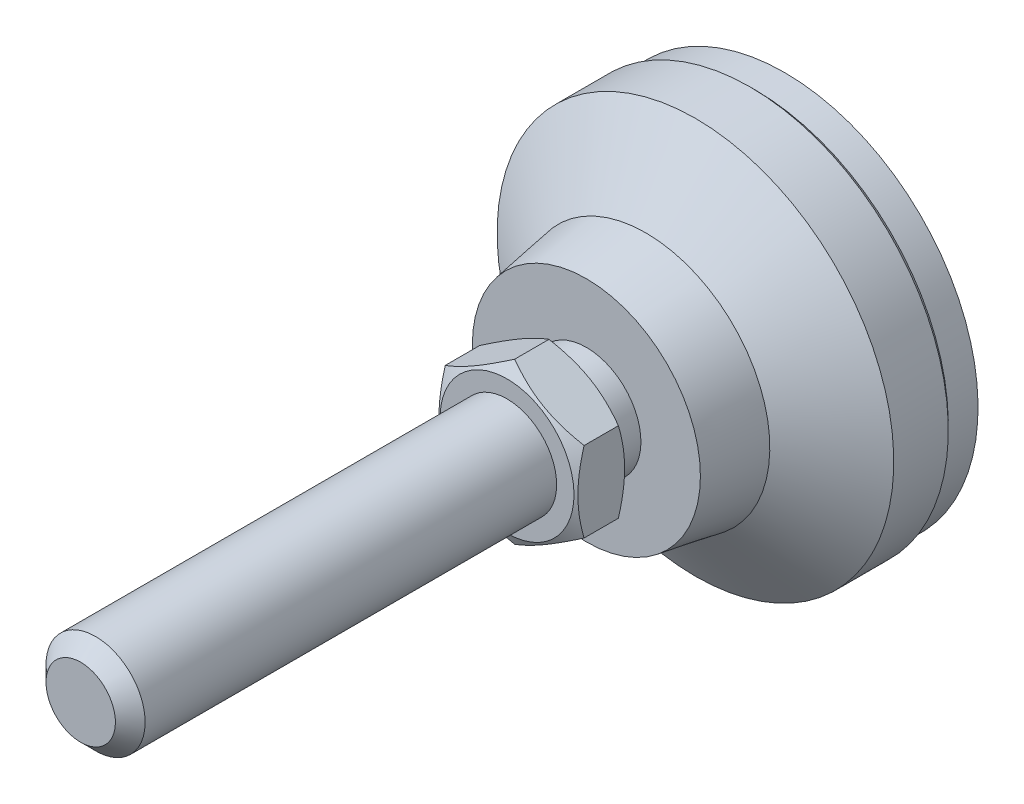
ISO-10303-21;
HEADER;
FILE_DESCRIPTION(('STEP AP214'),'2;1');
FILE_NAME('part.step','',(''),(''),'','','');
FILE_SCHEMA(('AUTOMOTIVE_DESIGN { 1 0 10303 214 1 1 1 1 }'));
ENDSEC;
DATA;
#1=APPLICATION_CONTEXT('core data for automotive mechanical design processes');
#2=APPLICATION_PROTOCOL_DEFINITION('international standard','automotive_design',2000,#1);
#3=PRODUCT_CONTEXT('',#1,'mechanical');
#4=PRODUCT('Part','Part','',(#3));
#5=PRODUCT_RELATED_PRODUCT_CATEGORY('part','',(#4));
#6=PRODUCT_DEFINITION_FORMATION('','',#4);
#7=PRODUCT_DEFINITION_CONTEXT('part definition',#1,'design');
#8=PRODUCT_DEFINITION('design','',#6,#7);
#9=PRODUCT_DEFINITION_SHAPE('','',#8);
#10=(LENGTH_UNIT() NAMED_UNIT(*) SI_UNIT(.MILLI.,.METRE.));
#11=(NAMED_UNIT(*) PLANE_ANGLE_UNIT() SI_UNIT($,.RADIAN.));
#12=(NAMED_UNIT(*) SI_UNIT($,.STERADIAN.) SOLID_ANGLE_UNIT());
#13=UNCERTAINTY_MEASURE_WITH_UNIT(LENGTH_MEASURE(1.E-05),#10,'distance_accuracy_value','');
#14=(GEOMETRIC_REPRESENTATION_CONTEXT(3) GLOBAL_UNCERTAINTY_ASSIGNED_CONTEXT((#13)) GLOBAL_UNIT_ASSIGNED_CONTEXT((#10,
#11,#12)) REPRESENTATION_CONTEXT('',''));
#15=CARTESIAN_POINT('',(0.,0.,0.));
#16=DIRECTION('',(0.,0.,1.));
#17=DIRECTION('',(1.,0.,0.));
#18=AXIS2_PLACEMENT_3D('',#15,#16,#17);
#19=CARTESIAN_POINT('',(0.,0.,1.99999999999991));
#20=DIRECTION('',(0.,0.,-1.));
#21=DIRECTION('',(0.,1.,0.));
#22=AXIS2_PLACEMENT_3D('',#19,#20,#21);
#23=CYLINDRICAL_SURFACE('',#22,20.);
#24=CARTESIAN_POINT('',(0.,0.,3.5));
#25=DIRECTION('',(0.,0.,-1.));
#26=DIRECTION('',(0.,1.,0.));
#27=AXIS2_PLACEMENT_3D('',#24,#25,#26);
#28=CIRCLE('',#27,20.);
#29=CARTESIAN_POINT('',(0.,20.,3.5));
#30=VERTEX_POINT('',#29);
#31=EDGE_CURVE('E114',#30,#30,#28,.F.);
#32=ORIENTED_EDGE('',*,*,#31,.T.);
#33=EDGE_LOOP('',(#32));
#34=FACE_BOUND('',#33,.T.);
#35=CARTESIAN_POINT('',(0.,0.,9.));
#36=DIRECTION('',(0.,0.,-1.));
#37=DIRECTION('',(0.,1.,0.));
#38=AXIS2_PLACEMENT_3D('',#35,#36,#37);
#39=CIRCLE('',#38,20.);
#40=CARTESIAN_POINT('',(0.,20.,9.));
#41=VERTEX_POINT('',#40);
#42=EDGE_CURVE('E108',#41,#41,#39,.T.);
#43=ORIENTED_EDGE('',*,*,#42,.T.);
#44=EDGE_LOOP('',(#43));
#45=FACE_BOUND('',#44,.T.);
#46=ADVANCED_FACE('F14',(#34,#45),#23,.T.);
#47=CARTESIAN_POINT('',(0.,0.,14.));
#48=DIRECTION('',(0.,0.,-1.));
#49=DIRECTION('',(0.,1.,0.));
#50=AXIS2_PLACEMENT_3D('',#47,#48,#49);
#51=CONICAL_SURFACE('',#50,12.5,0.98279372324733);
#52=ORIENTED_EDGE('',*,*,#42,.F.);
#53=EDGE_LOOP('',(#52));
#54=FACE_BOUND('',#53,.T.);
#55=CARTESIAN_POINT('',(0.,0.,14.));
#56=DIRECTION('',(0.,0.,-1.));
#57=DIRECTION('',(0.,1.,0.));
#58=AXIS2_PLACEMENT_3D('',#55,#56,#57);
#59=CIRCLE('',#58,12.5);
#60=CARTESIAN_POINT('',(0.,12.5,14.));
#61=VERTEX_POINT('',#60);
#62=EDGE_CURVE('E105',#61,#61,#59,.T.);
#63=ORIENTED_EDGE('',*,*,#62,.T.);
#64=EDGE_LOOP('',(#63));
#65=FACE_BOUND('',#64,.T.);
#66=ADVANCED_FACE('F230',(#54,#65),#51,.T.);
#67=CARTESIAN_POINT('',(0.,0.,20.));
#68=DIRECTION('',(0.,0.,-1.));
#69=DIRECTION('',(0.,1.,0.));
#70=AXIS2_PLACEMENT_3D('',#67,#68,#69);
#71=CONICAL_SURFACE('',#70,11.5,0.165148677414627);
#72=ORIENTED_EDGE('',*,*,#62,.F.);
#73=EDGE_LOOP('',(#72));
#74=FACE_BOUND('',#73,.T.);
#75=CARTESIAN_POINT('',(0.,0.,20.));
#76=DIRECTION('',(0.,0.,-1.));
#77=DIRECTION('',(0.,1.,0.));
#78=AXIS2_PLACEMENT_3D('',#75,#76,#77);
#79=CIRCLE('',#78,11.5);
#80=CARTESIAN_POINT('',(0.,11.5,20.));
#81=VERTEX_POINT('',#80);
#82=EDGE_CURVE('E102',#81,#81,#79,.T.);
#83=ORIENTED_EDGE('',*,*,#82,.T.);
#84=EDGE_LOOP('',(#83));
#85=FACE_BOUND('',#84,.T.);
#86=ADVANCED_FACE('F226',(#74,#85),#71,.T.);
#87=CARTESIAN_POINT('',(-11.5,0.,20.));
#88=DIRECTION('',(0.,0.,-1.));
#89=DIRECTION('',(0.,1.,0.));
#90=AXIS2_PLACEMENT_3D('',#87,#88,#89);
#91=PLANE('',#90);
#92=ORIENTED_EDGE('',*,*,#82,.F.);
#93=EDGE_LOOP('',(#92));
#94=FACE_BOUND('',#93,.T.);
#95=CARTESIAN_POINT('',(0.,0.,20.));
#96=DIRECTION('',(0.,0.,-1.));
#97=DIRECTION('',(0.,1.,0.));
#98=AXIS2_PLACEMENT_3D('',#95,#96,#97);
#99=CIRCLE('',#98,5.49999999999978);
#100=CARTESIAN_POINT('',(0.,5.49999999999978,20.));
#101=VERTEX_POINT('',#100);
#102=EDGE_CURVE('E99',#101,#101,#99,.T.);
#103=ORIENTED_EDGE('',*,*,#102,.T.);
#104=EDGE_LOOP('',(#103));
#105=FACE_BOUND('',#104,.T.);
#106=ADVANCED_FACE('F222',(#94,#105),#91,.F.);
#107=CARTESIAN_POINT('',(0.,0.,1.99999999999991));
#108=DIRECTION('',(0.,0.,-1.));
#109=DIRECTION('',(0.,1.,0.));
#110=AXIS2_PLACEMENT_3D('',#107,#108,#109);
#111=CYLINDRICAL_SURFACE('',#110,5.49999999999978);
#112=ORIENTED_EDGE('',*,*,#102,.F.);
#113=EDGE_LOOP('',(#112));
#114=FACE_BOUND('',#113,.T.);
#115=CARTESIAN_POINT('',(0.,0.,23.));
#116=DIRECTION('',(0.,0.,-1.));
#117=DIRECTION('',(0.,1.,0.));
#118=AXIS2_PLACEMENT_3D('',#115,#116,#117);
#119=CIRCLE('',#118,5.49999999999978);
#120=CARTESIAN_POINT('',(0.,5.49999999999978,23.));
#121=VERTEX_POINT('',#120);
#122=EDGE_CURVE('E96',#121,#121,#119,.T.);
#123=ORIENTED_EDGE('',*,*,#122,.T.);
#124=EDGE_LOOP('',(#123));
#125=FACE_BOUND('',#124,.T.);
#126=ADVANCED_FACE('F218',(#114,#125),#111,.T.);
#127=CARTESIAN_POINT('',(-5.49999999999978,0.,23.));
#128=DIRECTION('',(0.,0.,1.));
#129=DIRECTION('',(0.,-1.,0.));
#130=AXIS2_PLACEMENT_3D('',#127,#128,#129);
#131=PLANE('',#130);
#132=CARTESIAN_POINT('',(0.,0.,23.));
#133=DIRECTION('',(0.,0.,1.));
#134=DIRECTION('',(0.,-1.,0.));
#135=AXIS2_PLACEMENT_3D('',#132,#133,#134);
#136=CIRCLE('',#135,6.75);
#137=CARTESIAN_POINT('',(0.,-6.75,23.));
#138=VERTEX_POINT('',#137);
#139=EDGE_CURVE('E304',#138,#138,#136,.T.);
#140=ORIENTED_EDGE('',*,*,#139,.F.);
#141=EDGE_LOOP('',(#140));
#142=FACE_BOUND('',#141,.T.);
#143=ORIENTED_EDGE('',*,*,#122,.F.);
#144=EDGE_LOOP('',(#143));
#145=FACE_BOUND('',#144,.T.);
#146=ADVANCED_FACE('F215',(#142,#145),#131,.F.);
#147=CARTESIAN_POINT('',(0.,0.,3.));
#148=DIRECTION('',(0.,0.,1.));
#149=DIRECTION('',(0.,-1.,0.));
#150=AXIS2_PLACEMENT_3D('',#147,#148,#149);
#151=CONICAL_SURFACE('',#150,19.5,0.785398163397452);
#152=ORIENTED_EDGE('',*,*,#31,.F.);
#153=EDGE_LOOP('',(#152));
#154=FACE_BOUND('',#153,.T.);
#155=CARTESIAN_POINT('',(0.,0.,3.));
#156=DIRECTION('',(0.,0.,-1.));
#157=DIRECTION('',(0.,1.,0.));
#158=AXIS2_PLACEMENT_3D('',#155,#156,#157);
#159=CIRCLE('',#158,19.5);
#160=CARTESIAN_POINT('',(0.,19.5,3.));
#161=VERTEX_POINT('',#160);
#162=EDGE_CURVE('E111',#161,#161,#159,.T.);
#163=ORIENTED_EDGE('',*,*,#162,.F.);
#164=EDGE_LOOP('',(#163));
#165=FACE_BOUND('',#164,.T.);
#166=ADVANCED_FACE('F16',(#154,#165),#151,.T.);
#167=CARTESIAN_POINT('',(0.,0.,0.));
#168=DIRECTION('',(0.,0.,1.));
#169=DIRECTION('',(0.,-1.,0.));
#170=AXIS2_PLACEMENT_3D('',#167,#168,#169);
#171=CYLINDRICAL_SURFACE('',#170,19.5);
#172=CARTESIAN_POINT('',(0.,0.,0.));
#173=DIRECTION('',(0.,0.,-1.));
#174=DIRECTION('',(0.,1.,0.));
#175=AXIS2_PLACEMENT_3D('',#172,#173,#174);
#176=CIRCLE('',#175,19.5);
#177=CARTESIAN_POINT('',(0.,19.5,0.));
#178=VERTEX_POINT('',#177);
#179=EDGE_CURVE('E277',#178,#178,#176,.T.);
#180=ORIENTED_EDGE('',*,*,#179,.F.);
#181=EDGE_LOOP('',(#180));
#182=FACE_BOUND('',#181,.T.);
#183=ORIENTED_EDGE('',*,*,#162,.T.);
#184=EDGE_LOOP('',(#183));
#185=FACE_BOUND('',#184,.T.);
#186=ADVANCED_FACE('F255',(#182,#185),#171,.T.);
#187=CARTESIAN_POINT('',(0.,0.,0.));
#188=DIRECTION('',(0.,0.,-1.));
#189=DIRECTION('',(0.,1.,0.));
#190=AXIS2_PLACEMENT_3D('',#187,#188,#189);
#191=PLANE('',#190);
#192=ORIENTED_EDGE('',*,*,#179,.T.);
#193=EDGE_LOOP('',(#192));
#194=FACE_BOUND('',#193,.T.);
#195=ADVANCED_FACE('F134',(#194),#191,.T.);
#196=CARTESIAN_POINT('',(0.,0.,23.));
#197=DIRECTION('',(0.,0.,1.));
#198=DIRECTION('',(0.,-1.,0.));
#199=AXIS2_PLACEMENT_3D('',#196,#197,#198);
#200=CONICAL_SURFACE('',#199,6.75,1.0471975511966);
#201=CARTESIAN_POINT('',(0.000200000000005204,-8.08301923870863,23.7696190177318));
#202=CARTESIAN_POINT('',(-0.153667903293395,-7.99418356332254,23.7183374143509));
#203=CARTESIAN_POINT('',(-0.308109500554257,-7.90501666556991,23.669383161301));
#204=CARTESIAN_POINT('',(-0.618246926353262,-7.72595873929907,23.5767703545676));
#205=CARTESIAN_POINT('',(-0.773943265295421,-7.63606741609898,23.5331140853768));
#206=CARTESIAN_POINT('',(-1.24352516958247,-7.36495417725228,23.4109491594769));
#207=CARTESIAN_POINT('',(-1.55926433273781,-7.18266208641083,23.3414631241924));
#208=CARTESIAN_POINT('',(-2.03176224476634,-6.90986528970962,23.2599825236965));
#209=CARTESIAN_POINT('',(-2.1871092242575,-6.82017566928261,23.2367710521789));
#210=CARTESIAN_POINT('',(-2.49850511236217,-6.64039116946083,23.1978487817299));
#211=CARTESIAN_POINT('',(-2.65455395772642,-6.55029632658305,23.1821373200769));
#212=CARTESIAN_POINT('',(-2.96692267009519,-6.36995016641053,23.1586154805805));
#213=CARTESIAN_POINT('',(-3.12324202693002,-6.27969914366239,23.1507961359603));
#214=CARTESIAN_POINT('',(-3.43601650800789,-6.09911871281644,23.1432178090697));
#215=CARTESIAN_POINT('',(-3.59247162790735,-6.00878930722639,23.1434585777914));
#216=CARTESIAN_POINT('',(-4.02110687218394,-5.76131663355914,23.1551972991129));
#217=CARTESIAN_POINT('',(-4.2931466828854,-5.60425437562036,23.1749033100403));
#218=CARTESIAN_POINT('',(-4.83541944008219,-5.29117305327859,23.2373910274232));
#219=CARTESIAN_POINT('',(-5.10565047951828,-5.13515508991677,23.2801940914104));
#220=CARTESIAN_POINT('',(-5.64901454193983,-4.82144370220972,23.3871892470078));
#221=CARTESIAN_POINT('',(-5.92207900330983,-4.66378986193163,23.4518346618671));
#222=CARTESIAN_POINT('',(-6.46413578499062,-4.35083323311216,23.5985536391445));
#223=CARTESIAN_POINT('',(-6.73313504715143,-4.19552643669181,23.680592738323));
#224=CARTESIAN_POINT('',(-7.0002,-4.04133641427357,23.7696190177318));
#225=B_SPLINE_CURVE_WITH_KNOTS('',3,(#201,#202,#203,#204,#205,#206,#207,#208,#209,#210,#211,
#212,#213,#214,#215,#216,#217,#218,#219,#220,#221,#222,#223,#224),.UNSPECIFIED.,.F.,.F.,(4,2,2,
2,2,2,2,2,2,2,2,4),(0.,0.554727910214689,1.10969417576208,2.2219327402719,2.76443041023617,
3.30688013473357,3.8487128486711,4.39052882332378,5.33376515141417,6.27787517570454,
7.24292418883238,8.20607866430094),.UNSPECIFIED.);
#226=CARTESIAN_POINT('',(0.,-8.08290376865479,23.7695523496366));
#227=VERTEX_POINT('',#226);
#228=CARTESIAN_POINT('',(-7.,-4.04145188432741,23.7695523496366));
#229=VERTEX_POINT('',#228);
#230=EDGE_CURVE('E73',#227,#229,#225,.T.);
#231=ORIENTED_EDGE('',*,*,#230,.T.);
#232=CARTESIAN_POINT('',(-7.,10.8625008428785,26.5637597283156));
#233=CARTESIAN_POINT('',(-7.,10.5567081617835,26.4153960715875));
#234=CARTESIAN_POINT('',(-7.,10.2502142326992,26.2684530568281));
#235=CARTESIAN_POINT('',(-7.,9.63545096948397,25.978207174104));
#236=CARTESIAN_POINT('',(-7.,9.32718136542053,25.8349048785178));
#237=CARTESIAN_POINT('',(-7.,8.70690876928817,25.5520197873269));
#238=CARTESIAN_POINT('',(-7.,8.39489459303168,25.4124614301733));
#239=CARTESIAN_POINT('',(-7.,7.76838697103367,25.1390469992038));
#240=CARTESIAN_POINT('',(-7.,7.45389364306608,25.005190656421));
#241=CARTESIAN_POINT('',(-7.,6.81175153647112,24.7404908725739));
#242=CARTESIAN_POINT('',(-7.,6.48400510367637,24.6098830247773));
#243=CARTESIAN_POINT('',(-7.,5.82468108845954,24.3585360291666));
#244=CARTESIAN_POINT('',(-7.,5.4931030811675,24.2377979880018));
#245=CARTESIAN_POINT('',(-7.,4.82620282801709,24.0093556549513));
#246=CARTESIAN_POINT('',(-7.,4.49088969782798,23.9016250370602));
#247=CARTESIAN_POINT('',(-7.,3.81546553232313,23.7026486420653));
#248=CARTESIAN_POINT('',(-7.,3.47535604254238,23.6113976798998));
#249=CARTESIAN_POINT('',(-7.,2.79197817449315,23.45024692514));
#250=CARTESIAN_POINT('',(-7.,2.44873790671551,23.3802311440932));
#251=CARTESIAN_POINT('',(-7.,1.93074648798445,23.2941616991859));
#252=CARTESIAN_POINT('',(-7.,1.75754818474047,23.2686297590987));
#253=CARTESIAN_POINT('',(-7.,1.41028841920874,23.2243845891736));
#254=CARTESIAN_POINT('',(-7.,1.23622704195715,23.205670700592));
#255=CARTESIAN_POINT('',(-7.,0.889751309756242,23.1756695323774));
#256=CARTESIAN_POINT('',(-7.,0.717345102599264,23.1642885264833));
#257=CARTESIAN_POINT('',(-7.,0.372205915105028,23.1488276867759));
#258=CARTESIAN_POINT('',(-7.,0.19947294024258,23.1447477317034));
#259=CARTESIAN_POINT('',(-7.,-0.146010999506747,23.1439863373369));
#260=CARTESIAN_POINT('',(-7.,-0.318761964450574,23.1473049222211));
#261=CARTESIAN_POINT('',(-7.,-0.663970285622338,23.1612594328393));
#262=CARTESIAN_POINT('',(-7.,-0.836427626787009,23.1718957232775));
#263=CARTESIAN_POINT('',(-7.,-1.25068890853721,23.2060092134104));
#264=CARTESIAN_POINT('',(-7.,-1.49221390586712,23.2329469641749));
#265=CARTESIAN_POINT('',(-7.,-1.97346436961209,23.2997070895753));
#266=CARTESIAN_POINT('',(-7.,-2.21318958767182,23.3395312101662));
#267=CARTESIAN_POINT('',(-7.,-2.9293952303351,23.4762208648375));
#268=CARTESIAN_POINT('',(-7.,-3.4026374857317,23.5902786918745));
#269=CARTESIAN_POINT('',(-7.,-4.11027375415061,23.7879838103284));
#270=CARTESIAN_POINT('',(-7.,-4.34834017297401,23.8592419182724));
#271=CARTESIAN_POINT('',(-7.,-4.82216059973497,24.009139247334));
#272=CARTESIAN_POINT('',(-7.,-5.05791459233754,24.0877785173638));
#273=CARTESIAN_POINT('',(-7.,-5.52718474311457,24.2511780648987));
#274=CARTESIAN_POINT('',(-7.,-5.76070161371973,24.3359363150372));
#275=CARTESIAN_POINT('',(-7.,-6.22580187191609,24.5105785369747));
#276=CARTESIAN_POINT('',(-7.,-6.45738528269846,24.6004624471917));
#277=CARTESIAN_POINT('',(-7.,-7.00610792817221,24.8193124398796));
#278=CARTESIAN_POINT('',(-7.,-7.32247845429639,24.9502024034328));
#279=CARTESIAN_POINT('',(-7.,-7.95251186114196,25.2183630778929));
#280=CARTESIAN_POINT('',(-7.,-8.26617457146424,25.3556341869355));
#281=CARTESIAN_POINT('',(-7.,-8.89129388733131,25.6352681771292));
#282=CARTESIAN_POINT('',(-7.,-9.20275002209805,25.7776321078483));
#283=CARTESIAN_POINT('',(-7.,-9.82377465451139,26.0664265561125));
#284=CARTESIAN_POINT('',(-7.,-10.1333431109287,26.2128571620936));
#285=CARTESIAN_POINT('',(-7.,-10.7512327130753,26.5091752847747));
#286=CARTESIAN_POINT('',(-7.,-11.0595521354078,26.6590663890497));
#287=CARTESIAN_POINT('',(-7.,-11.674858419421,26.9615616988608));
#288=CARTESIAN_POINT('',(-7.,-11.9818452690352,27.1141659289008));
#289=CARTESIAN_POINT('',(-7.,-12.9010435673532,27.5752812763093));
#290=CARTESIAN_POINT('',(-7.,-13.5115774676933,27.8871360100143));
#291=CARTESIAN_POINT('',(-7.,-14.6778741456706,28.4904503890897));
#292=CARTESIAN_POINT('',(-7.,-15.2339003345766,28.7814031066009));
#293=CARTESIAN_POINT('',(-7.,-16.343890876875,29.3672608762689));
#294=CARTESIAN_POINT('',(-7.,-16.8978551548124,29.6621660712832));
#295=CARTESIAN_POINT('',(-7.,-18.0027779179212,30.2542339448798));
#296=CARTESIAN_POINT('',(-7.,-18.5537404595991,30.5513890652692));
#297=CARTESIAN_POINT('',(-7.,-19.6543487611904,31.1480557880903));
#298=CARTESIAN_POINT('',(-7.,-20.2039945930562,31.44756725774));
#299=CARTESIAN_POINT('',(-7.,-20.7531565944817,31.7479573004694));
#300=B_SPLINE_CURVE_WITH_KNOTS('',3,(#232,#233,#234,#235,#236,#237,#238,#239,#240,#241,#242,
#243,#244,#245,#246,#247,#248,#249,#250,#251,#252,#253,#254,#255,#256,#257,#258,#259,#260,#261,
#262,#263,#264,#265,#266,#267,#268,#269,#270,#271,#272,#273,#274,#275,#276,#277,#278,#279,#280,
#281,#282,#283,#284,#285,#286,#287,#288,#289,#290,#291,#292,#293,#294,#295,#296,#297,#298,#299),
.UNSPECIFIED.,.F.,.F.,(4,2,2,2,2,2,2,2,2,2,2,2,2,2,2,2,2,2,2,2,2,2,2,2,2,2,2,2,2,2,2,2,2,4),(0.,
1.01966355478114,2.03948643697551,3.06485011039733,4.09016536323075,5.14847727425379,
6.20690768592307,7.26315867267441,8.31907674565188,9.36911888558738,9.89421604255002,
10.4192624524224,10.9374573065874,11.4556435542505,11.9738314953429,12.4920452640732,
13.2207013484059,13.9494561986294,15.4077702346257,16.1532147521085,16.8986642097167,
17.6438678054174,18.3890624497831,19.4161007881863,20.4432032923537,21.4705187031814,
22.497856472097,23.526311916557,24.5547766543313,26.6114239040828,28.4940560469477,
30.3767564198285,32.2547141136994,34.1325667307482),.UNSPECIFIED.);
#301=CARTESIAN_POINT('',(-7.,4.04145188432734,23.7695523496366));
#302=VERTEX_POINT('',#301);
#303=EDGE_CURVE('E81',#229,#302,#300,.F.);
#304=ORIENTED_EDGE('',*,*,#303,.T.);
#305=CARTESIAN_POINT('',(-7.0002,4.0413364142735,23.7696190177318));
#306=CARTESIAN_POINT('',(-6.8463320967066,4.13017208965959,23.7183374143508));
#307=CARTESIAN_POINT('',(-6.69189049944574,4.21933898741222,23.669383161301));
#308=CARTESIAN_POINT('',(-6.38175307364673,4.39839691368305,23.5767703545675));
#309=CARTESIAN_POINT('',(-6.22605673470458,4.48828823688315,23.5331140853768));
#310=CARTESIAN_POINT('',(-5.75647483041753,4.75940147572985,23.4109491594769));
#311=CARTESIAN_POINT('',(-5.4407356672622,4.94169356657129,23.3414631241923));
#312=CARTESIAN_POINT('',(-4.96823775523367,5.2144903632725,23.2599825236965));
#313=CARTESIAN_POINT('',(-4.81289077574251,5.30417998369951,23.2367710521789));
#314=CARTESIAN_POINT('',(-4.50149488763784,5.48396448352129,23.1978487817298));
#315=CARTESIAN_POINT('',(-4.34544604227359,5.57405932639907,23.1821373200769));
#316=CARTESIAN_POINT('',(-4.03307732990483,5.75440548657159,23.1586154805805));
#317=CARTESIAN_POINT('',(-3.87675797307,5.84465650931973,23.1507961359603));
#318=CARTESIAN_POINT('',(-3.56398349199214,6.02523694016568,23.1432178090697));
#319=CARTESIAN_POINT('',(-3.40752837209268,6.11556634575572,23.1434585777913));
#320=CARTESIAN_POINT('',(-2.97889312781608,6.36303901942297,23.1551972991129));
#321=CARTESIAN_POINT('',(-2.70685331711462,6.52010127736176,23.1749033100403));
#322=CARTESIAN_POINT('',(-2.16458055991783,6.83318259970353,23.2373910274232));
#323=CARTESIAN_POINT('',(-1.89434952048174,6.98920056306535,23.2801940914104));
#324=CARTESIAN_POINT('',(-1.35098545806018,7.3029119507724,23.3871892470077));
#325=CARTESIAN_POINT('',(-1.07792099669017,7.4605657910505,23.4518346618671));
#326=CARTESIAN_POINT('',(-0.535864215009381,7.77352241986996,23.5985536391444));
#327=CARTESIAN_POINT('',(-0.266864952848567,7.92882921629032,23.6805927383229));
#328=CARTESIAN_POINT('',(0.000200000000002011,8.08301923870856,23.7696190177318));
#329=B_SPLINE_CURVE_WITH_KNOTS('',3,(#305,#306,#307,#308,#309,#310,#311,#312,#313,#314,#315,
#316,#317,#318,#319,#320,#321,#322,#323,#324,#325,#326,#327,#328),.UNSPECIFIED.,.F.,.F.,(4,2,2,
2,2,2,2,2,2,2,2,4),(0.,0.554727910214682,1.10969417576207,2.22193274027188,2.76443041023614,
3.30688013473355,3.84871284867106,4.39052882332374,5.33376515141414,6.27787517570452,
7.24292418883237,8.20607866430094),.UNSPECIFIED.);
#330=CARTESIAN_POINT('',(0.,8.08290376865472,23.7695523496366));
#331=VERTEX_POINT('',#330);
#332=EDGE_CURVE('E193',#302,#331,#329,.T.);
#333=ORIENTED_EDGE('',*,*,#332,.T.);
#334=CARTESIAN_POINT('',(-0.000199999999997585,8.08301923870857,23.7696190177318));
#335=CARTESIAN_POINT('',(0.153667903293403,7.99418356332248,23.7183374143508));
#336=CARTESIAN_POINT('',(0.308109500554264,7.90501666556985,23.669383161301));
#337=CARTESIAN_POINT('',(0.618246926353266,7.72595873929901,23.5767703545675));
#338=CARTESIAN_POINT('',(0.773943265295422,7.63606741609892,23.5331140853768));
#339=CARTESIAN_POINT('',(1.24352516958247,7.36495417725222,23.4109491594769));
#340=CARTESIAN_POINT('',(1.55926433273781,7.18266208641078,23.3414631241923));
#341=CARTESIAN_POINT('',(2.03176224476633,6.90986528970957,23.2599825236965));
#342=CARTESIAN_POINT('',(2.18710922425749,6.82017566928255,23.2367710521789));
#343=CARTESIAN_POINT('',(2.49850511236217,6.64039116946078,23.1978487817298));
#344=CARTESIAN_POINT('',(2.65455395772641,6.550296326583,23.1821373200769));
#345=CARTESIAN_POINT('',(2.96692267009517,6.36995016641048,23.1586154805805));
#346=CARTESIAN_POINT('',(3.12324202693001,6.27969914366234,23.1507961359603));
#347=CARTESIAN_POINT('',(3.43601650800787,6.09911871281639,23.1432178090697));
#348=CARTESIAN_POINT('',(3.59247162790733,6.00878930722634,23.1434585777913));
#349=CARTESIAN_POINT('',(4.02110687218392,5.76131663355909,23.1551972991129));
#350=CARTESIAN_POINT('',(4.29314668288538,5.60425437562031,23.1749033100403));
#351=CARTESIAN_POINT('',(4.83541944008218,5.29117305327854,23.2373910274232));
#352=CARTESIAN_POINT('',(5.10565047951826,5.13515508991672,23.2801940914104));
#353=CARTESIAN_POINT('',(5.64901454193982,4.82144370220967,23.3871892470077));
#354=CARTESIAN_POINT('',(5.92207900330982,4.66378986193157,23.4518346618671));
#355=CARTESIAN_POINT('',(6.46413578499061,4.35083323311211,23.5985536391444));
#356=CARTESIAN_POINT('',(6.73313504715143,4.19552643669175,23.6805927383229));
#357=CARTESIAN_POINT('',(7.0002,4.04133641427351,23.7696190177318));
#358=B_SPLINE_CURVE_WITH_KNOTS('',3,(#334,#335,#336,#337,#338,#339,#340,#341,#342,#343,#344,
#345,#346,#347,#348,#349,#350,#351,#352,#353,#354,#355,#356,#357),.UNSPECIFIED.,.F.,.F.,(4,2,2,
2,2,2,2,2,2,2,2,4),(0.,0.554727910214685,1.10969417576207,2.22193274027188,2.76443041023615,
3.30688013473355,3.84871284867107,4.39052882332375,5.33376515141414,6.27787517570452,
7.24292418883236,8.20607866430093),.UNSPECIFIED.);
#359=CARTESIAN_POINT('',(7.,4.04145188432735,23.7695523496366));
#360=VERTEX_POINT('',#359);
#361=EDGE_CURVE('E303',#331,#360,#358,.T.);
#362=ORIENTED_EDGE('',*,*,#361,.T.);
#363=CARTESIAN_POINT('',(7.,10.8625008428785,26.5637597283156));
#364=CARTESIAN_POINT('',(7.,10.5567081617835,26.4153960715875));
#365=CARTESIAN_POINT('',(7.,10.2502142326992,26.2684530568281));
#366=CARTESIAN_POINT('',(7.,9.63545096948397,25.978207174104));
#367=CARTESIAN_POINT('',(7.,9.32718136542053,25.8349048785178));
#368=CARTESIAN_POINT('',(7.,8.70690876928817,25.5520197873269));
#369=CARTESIAN_POINT('',(7.,8.39489459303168,25.4124614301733));
#370=CARTESIAN_POINT('',(7.,7.76838697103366,25.1390469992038));
#371=CARTESIAN_POINT('',(7.,7.45389364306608,25.005190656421));
#372=CARTESIAN_POINT('',(7.,6.81175153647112,24.7404908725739));
#373=CARTESIAN_POINT('',(7.,6.48400510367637,24.6098830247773));
#374=CARTESIAN_POINT('',(7.,5.82468108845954,24.3585360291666));
#375=CARTESIAN_POINT('',(7.,5.4931030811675,24.2377979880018));
#376=CARTESIAN_POINT('',(7.,4.82620282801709,24.0093556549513));
#377=CARTESIAN_POINT('',(7.,4.49088969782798,23.9016250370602));
#378=CARTESIAN_POINT('',(7.,3.81546553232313,23.7026486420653));
#379=CARTESIAN_POINT('',(7.,3.47535604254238,23.6113976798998));
#380=CARTESIAN_POINT('',(7.,2.79197817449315,23.45024692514));
#381=CARTESIAN_POINT('',(7.,2.44873790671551,23.3802311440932));
#382=CARTESIAN_POINT('',(7.,1.93074648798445,23.2941616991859));
#383=CARTESIAN_POINT('',(7.,1.75754818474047,23.2686297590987));
#384=CARTESIAN_POINT('',(7.,1.41028841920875,23.2243845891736));
#385=CARTESIAN_POINT('',(7.,1.23622704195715,23.205670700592));
#386=CARTESIAN_POINT('',(7.,0.889751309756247,23.1756695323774));
#387=CARTESIAN_POINT('',(7.,0.717345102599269,23.1642885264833));
#388=CARTESIAN_POINT('',(7.,0.372205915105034,23.1488276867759));
#389=CARTESIAN_POINT('',(7.,0.199472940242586,23.1447477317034));
#390=CARTESIAN_POINT('',(7.,-0.146010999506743,23.1439863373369));
#391=CARTESIAN_POINT('',(7.,-0.318761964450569,23.1473049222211));
#392=CARTESIAN_POINT('',(7.,-0.663970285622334,23.1612594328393));
#393=CARTESIAN_POINT('',(7.,-0.836427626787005,23.1718957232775));
#394=CARTESIAN_POINT('',(7.,-1.2506889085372,23.2060092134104));
#395=CARTESIAN_POINT('',(7.,-1.49221390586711,23.2329469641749));
#396=CARTESIAN_POINT('',(7.,-1.97346436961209,23.2997070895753));
#397=CARTESIAN_POINT('',(7.,-2.21318958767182,23.3395312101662));
#398=CARTESIAN_POINT('',(7.,-2.9293952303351,23.4762208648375));
#399=CARTESIAN_POINT('',(7.,-3.4026374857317,23.5902786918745));
#400=CARTESIAN_POINT('',(7.,-4.11027375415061,23.7879838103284));
#401=CARTESIAN_POINT('',(7.,-4.34834017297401,23.8592419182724));
#402=CARTESIAN_POINT('',(7.,-4.82216059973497,24.009139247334));
#403=CARTESIAN_POINT('',(7.,-5.05791459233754,24.0877785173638));
#404=CARTESIAN_POINT('',(7.,-5.52718474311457,24.2511780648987));
#405=CARTESIAN_POINT('',(7.,-5.76070161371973,24.3359363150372));
#406=CARTESIAN_POINT('',(7.,-6.22580187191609,24.5105785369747));
#407=CARTESIAN_POINT('',(7.,-6.45738528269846,24.6004624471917));
#408=CARTESIAN_POINT('',(7.,-7.00610792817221,24.8193124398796));
#409=CARTESIAN_POINT('',(7.,-7.32247845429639,24.9502024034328));
#410=CARTESIAN_POINT('',(7.,-7.95251186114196,25.2183630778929));
#411=CARTESIAN_POINT('',(7.,-8.26617457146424,25.3556341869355));
#412=CARTESIAN_POINT('',(7.,-8.89129388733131,25.6352681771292));
#413=CARTESIAN_POINT('',(7.,-9.20275002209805,25.7776321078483));
#414=CARTESIAN_POINT('',(7.,-9.82377465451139,26.0664265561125));
#415=CARTESIAN_POINT('',(7.,-10.1333431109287,26.2128571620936));
#416=CARTESIAN_POINT('',(7.,-10.7512327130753,26.5091752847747));
#417=CARTESIAN_POINT('',(7.,-11.0595521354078,26.6590663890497));
#418=CARTESIAN_POINT('',(7.,-11.674858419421,26.9615616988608));
#419=CARTESIAN_POINT('',(7.,-11.9818452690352,27.1141659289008));
#420=CARTESIAN_POINT('',(7.,-12.9010435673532,27.5752812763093));
#421=CARTESIAN_POINT('',(7.,-13.5115774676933,27.8871360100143));
#422=CARTESIAN_POINT('',(7.,-14.6778741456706,28.4904503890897));
#423=CARTESIAN_POINT('',(7.,-15.2339003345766,28.7814031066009));
#424=CARTESIAN_POINT('',(7.,-16.343890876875,29.3672608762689));
#425=CARTESIAN_POINT('',(7.,-16.8978551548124,29.6621660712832));
#426=CARTESIAN_POINT('',(7.,-18.0027779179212,30.2542339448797));
#427=CARTESIAN_POINT('',(7.,-18.5537404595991,30.5513890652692));
#428=CARTESIAN_POINT('',(7.,-19.6543487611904,31.1480557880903));
#429=CARTESIAN_POINT('',(7.,-20.2039945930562,31.44756725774));
#430=CARTESIAN_POINT('',(7.,-20.7531565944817,31.7479573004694));
#431=B_SPLINE_CURVE_WITH_KNOTS('',3,(#363,#364,#365,#366,#367,#368,#369,#370,#371,#372,#373,
#374,#375,#376,#377,#378,#379,#380,#381,#382,#383,#384,#385,#386,#387,#388,#389,#390,#391,#392,
#393,#394,#395,#396,#397,#398,#399,#400,#401,#402,#403,#404,#405,#406,#407,#408,#409,#410,#411,
#412,#413,#414,#415,#416,#417,#418,#419,#420,#421,#422,#423,#424,#425,#426,#427,#428,#429,#430),
.UNSPECIFIED.,.F.,.F.,(4,2,2,2,2,2,2,2,2,2,2,2,2,2,2,2,2,2,2,2,2,2,2,2,2,2,2,2,2,2,2,2,2,4),(0.,
1.01966355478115,2.03948643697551,3.06485011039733,4.09016536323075,5.1484772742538,
6.20690768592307,7.26315867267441,8.31907674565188,9.36911888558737,9.89421604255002,
10.4192624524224,10.9374573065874,11.4556435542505,11.9738314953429,12.4920452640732,
13.2207013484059,13.9494561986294,15.4077702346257,16.1532147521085,16.8986642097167,
17.6438678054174,18.3890624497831,19.4161007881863,20.4432032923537,21.4705187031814,
22.497856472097,23.526311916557,24.5547766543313,26.6114239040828,28.4940560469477,
30.3767564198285,32.2547141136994,34.1325667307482),.UNSPECIFIED.);
#432=CARTESIAN_POINT('',(7.,-4.04145188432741,23.7695523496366));
#433=VERTEX_POINT('',#432);
#434=EDGE_CURVE('E34',#360,#433,#431,.T.);
#435=ORIENTED_EDGE('',*,*,#434,.T.);
#436=CARTESIAN_POINT('',(7.0002,-4.04133641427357,23.7696190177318));
#437=CARTESIAN_POINT('',(6.8463320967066,-4.13017208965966,23.7183374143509));
#438=CARTESIAN_POINT('',(6.69189049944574,-4.2193389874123,23.669383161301));
#439=CARTESIAN_POINT('',(6.38175307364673,-4.39839691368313,23.5767703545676));
#440=CARTESIAN_POINT('',(6.22605673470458,-4.48828823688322,23.5331140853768));
#441=CARTESIAN_POINT('',(5.75647483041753,-4.75940147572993,23.4109491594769));
#442=CARTESIAN_POINT('',(5.44073566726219,-4.94169356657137,23.3414631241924));
#443=CARTESIAN_POINT('',(4.96823775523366,-5.21449036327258,23.2599825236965));
#444=CARTESIAN_POINT('',(4.8128907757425,-5.30417998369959,23.2367710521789));
#445=CARTESIAN_POINT('',(4.50149488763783,-5.48396448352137,23.1978487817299));
#446=CARTESIAN_POINT('',(4.34544604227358,-5.57405932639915,23.1821373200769));
#447=CARTESIAN_POINT('',(4.03307732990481,-5.75440548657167,23.1586154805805));
#448=CARTESIAN_POINT('',(3.87675797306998,-5.84465650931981,23.1507961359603));
#449=CARTESIAN_POINT('',(3.56398349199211,-6.02523694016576,23.1432178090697));
#450=CARTESIAN_POINT('',(3.40752837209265,-6.11556634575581,23.1434585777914));
#451=CARTESIAN_POINT('',(2.97889312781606,-6.36303901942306,23.1551972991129));
#452=CARTESIAN_POINT('',(2.7068533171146,-6.52010127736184,23.1749033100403));
#453=CARTESIAN_POINT('',(2.16458055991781,-6.83318259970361,23.2373910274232));
#454=CARTESIAN_POINT('',(1.89434952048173,-6.98920056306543,23.2801940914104));
#455=CARTESIAN_POINT('',(1.35098545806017,-7.30291195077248,23.3871892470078));
#456=CARTESIAN_POINT('',(1.07792099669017,-7.46056579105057,23.4518346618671));
#457=CARTESIAN_POINT('',(0.535864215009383,-7.77352241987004,23.5985536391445));
#458=CARTESIAN_POINT('',(0.266864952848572,-7.92882921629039,23.680592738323));
#459=CARTESIAN_POINT('',(-0.000199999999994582,-8.08301923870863,23.7696190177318));
#460=B_SPLINE_CURVE_WITH_KNOTS('',3,(#436,#437,#438,#439,#440,#441,#442,#443,#444,#445,#446,
#447,#448,#449,#450,#451,#452,#453,#454,#455,#456,#457,#458,#459),.UNSPECIFIED.,.F.,.F.,(4,2,2,
2,2,2,2,2,2,2,2,4),(0.,0.554727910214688,1.10969417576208,2.22193274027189,2.76443041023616,
3.30688013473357,3.84871284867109,4.39052882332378,5.33376515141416,6.27787517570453,
7.24292418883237,8.20607866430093),.UNSPECIFIED.);
#461=EDGE_CURVE('E9',#433,#227,#460,.T.);
#462=ORIENTED_EDGE('',*,*,#461,.T.);
#463=EDGE_LOOP('',(#231,#304,#333,#362,#435,#462));
#464=FACE_BOUND('',#463,.T.);
#465=ORIENTED_EDGE('',*,*,#139,.T.);
#466=EDGE_LOOP('',(#465));
#467=FACE_BOUND('',#466,.T.);
#468=ADVANCED_FACE('F71',(#464,#467),#200,.T.);
#469=CARTESIAN_POINT('',(-2.79999999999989,0.,71.));
#470=DIRECTION('',(0.,0.,-1.));
#471=DIRECTION('',(0.,1.,0.));
#472=AXIS2_PLACEMENT_3D('',#469,#470,#471);
#473=PLANE('',#472);
#474=CARTESIAN_POINT('',(0.,0.,71.));
#475=DIRECTION('',(0.,0.,-1.));
#476=DIRECTION('',(0.,1.,0.));
#477=AXIS2_PLACEMENT_3D('',#474,#475,#476);
#478=CIRCLE('',#477,3.5);
#479=CARTESIAN_POINT('',(0.,3.5,71.));
#480=VERTEX_POINT('',#479);
#481=EDGE_CURVE('E87',#480,#480,#478,.T.);
#482=ORIENTED_EDGE('',*,*,#481,.F.);
#483=EDGE_LOOP('',(#482));
#484=FACE_BOUND('',#483,.T.);
#485=ADVANCED_FACE('F206',(#484),#473,.F.);
#486=CARTESIAN_POINT('',(0.,0.,71.));
#487=DIRECTION('',(0.,0.,-1.));
#488=DIRECTION('',(0.,1.,0.));
#489=AXIS2_PLACEMENT_3D('',#486,#487,#488);
#490=CONICAL_SURFACE('',#489,3.5,0.785398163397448);
#491=CARTESIAN_POINT('',(0.,0.,69.5));
#492=DIRECTION('',(0.,0.,-1.));
#493=DIRECTION('',(0.,1.,0.));
#494=AXIS2_PLACEMENT_3D('',#491,#492,#493);
#495=CIRCLE('',#494,5.);
#496=CARTESIAN_POINT('',(0.,5.,69.5));
#497=VERTEX_POINT('',#496);
#498=EDGE_CURVE('E92',#497,#497,#495,.T.);
#499=ORIENTED_EDGE('',*,*,#498,.F.);
#500=EDGE_LOOP('',(#499));
#501=FACE_BOUND('',#500,.T.);
#502=ORIENTED_EDGE('',*,*,#481,.T.);
#503=EDGE_LOOP('',(#502));
#504=FACE_BOUND('',#503,.T.);
#505=ADVANCED_FACE('F183',(#501,#504),#490,.T.);
#506=CARTESIAN_POINT('',(0.,0.,-1.35897435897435));
#507=DIRECTION('',(0.,0.,-1.));
#508=DIRECTION('',(0.,1.,0.));
#509=AXIS2_PLACEMENT_3D('',#506,#507,#508);
#510=CYLINDRICAL_SURFACE('',#509,5.);
#511=CARTESIAN_POINT('',(0.,0.,28.));
#512=DIRECTION('',(0.,0.,-1.));
#513=DIRECTION('',(0.,1.,0.));
#514=AXIS2_PLACEMENT_3D('',#511,#512,#513);
#515=CIRCLE('',#514,5.);
#516=CARTESIAN_POINT('',(0.,5.,28.));
#517=VERTEX_POINT('',#516);
#518=EDGE_CURVE('E117',#517,#517,#515,.F.);
#519=ORIENTED_EDGE('',*,*,#518,.T.);
#520=EDGE_LOOP('',(#519));
#521=FACE_BOUND('',#520,.T.);
#522=ORIENTED_EDGE('',*,*,#498,.T.);
#523=EDGE_LOOP('',(#522));
#524=FACE_BOUND('',#523,.T.);
#525=ADVANCED_FACE('F213',(#521,#524),#510,.T.);
#526=CARTESIAN_POINT('',(-3.99999999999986,0.,28.));
#527=DIRECTION('',(0.,0.,-1.));
#528=DIRECTION('',(0.,1.,0.));
#529=AXIS2_PLACEMENT_3D('',#526,#527,#528);
#530=PLANE('',#529);
#531=CARTESIAN_POINT('',(0.,0.,28.));
#532=DIRECTION('',(0.,0.,1.));
#533=DIRECTION('',(0.,-1.,0.));
#534=AXIS2_PLACEMENT_3D('',#531,#532,#533);
#535=CIRCLE('',#534,6.75);
#536=CARTESIAN_POINT('',(0.,-6.75,28.));
#537=VERTEX_POINT('',#536);
#538=EDGE_CURVE('E80',#537,#537,#535,.T.);
#539=ORIENTED_EDGE('',*,*,#538,.T.);
#540=EDGE_LOOP('',(#539));
#541=FACE_BOUND('',#540,.T.);
#542=ORIENTED_EDGE('',*,*,#518,.F.);
#543=EDGE_LOOP('',(#542));
#544=FACE_BOUND('',#543,.T.);
#545=ADVANCED_FACE('F131',(#541,#544),#530,.F.);
#546=CARTESIAN_POINT('',(0.,0.,26.0528869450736));
#547=DIRECTION('',(0.,0.,-1.));
#548=DIRECTION('',(0.,1.,0.));
#549=AXIS2_PLACEMENT_3D('',#546,#547,#548);
#550=CONICAL_SURFACE('',#549,10.122498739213,1.0471975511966);
#551=CARTESIAN_POINT('',(-7.0002,-4.04133641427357,27.230380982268));
#552=CARTESIAN_POINT('',(-6.84633209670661,-4.13017208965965,27.281662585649));
#553=CARTESIAN_POINT('',(-6.69189049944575,-4.21933898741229,27.3306168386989));
#554=CARTESIAN_POINT('',(-6.38175307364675,-4.39839691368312,27.4232296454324));
#555=CARTESIAN_POINT('',(-6.22605673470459,-4.48828823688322,27.4668859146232));
#556=CARTESIAN_POINT('',(-5.75647483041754,-4.75940147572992,27.589050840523));
#557=CARTESIAN_POINT('',(-5.4407356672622,-4.94169356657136,27.6585368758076));
#558=CARTESIAN_POINT('',(-4.96823775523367,-5.21449036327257,27.7400174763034));
#559=CARTESIAN_POINT('',(-4.81289077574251,-5.30417998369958,27.763228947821));
#560=CARTESIAN_POINT('',(-4.50149488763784,-5.48396448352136,27.8021512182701));
#561=CARTESIAN_POINT('',(-4.34544604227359,-5.57405932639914,27.817862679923));
#562=CARTESIAN_POINT('',(-4.03307732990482,-5.75440548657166,27.8413845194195));
#563=CARTESIAN_POINT('',(-3.87675797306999,-5.8446565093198,27.8492038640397));
#564=CARTESIAN_POINT('',(-3.56398349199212,-6.02523694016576,27.8567821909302));
#565=CARTESIAN_POINT('',(-3.40752837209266,-6.11556634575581,27.8565414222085));
#566=CARTESIAN_POINT('',(-2.97889312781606,-6.36303901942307,27.8448027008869));
#567=CARTESIAN_POINT('',(-2.7068533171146,-6.52010127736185,27.8250966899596));
#568=CARTESIAN_POINT('',(-2.1645805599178,-6.83318259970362,27.7626089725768));
#569=CARTESIAN_POINT('',(-1.89434952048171,-6.98920056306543,27.7198059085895));
#570=CARTESIAN_POINT('',(-1.35098545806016,-7.30291195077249,27.6128107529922));
#571=CARTESIAN_POINT('',(-1.07792099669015,-7.46056579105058,27.5481653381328));
#572=CARTESIAN_POINT('',(-0.535864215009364,-7.77352241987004,27.4014463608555));
#573=CARTESIAN_POINT('',(-0.266864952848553,-7.9288292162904,27.3194072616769));
#574=CARTESIAN_POINT('',(0.000200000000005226,-8.08301923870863,27.230380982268));
#575=B_SPLINE_CURVE_WITH_KNOTS('',3,(#551,#552,#553,#554,#555,#556,#557,#558,#559,#560,#561,
#562,#563,#564,#565,#566,#567,#568,#569,#570,#571,#572,#573,#574),.UNSPECIFIED.,.F.,.F.,(4,2,2,
2,2,2,2,2,2,2,2,4),(0.,0.554727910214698,1.1096941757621,2.2219327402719,2.76443041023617,
3.30688013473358,3.84871284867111,4.3905288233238,5.3337651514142,6.27787517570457,
7.24292418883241,8.20607866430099),.UNSPECIFIED.);
#576=CARTESIAN_POINT('',(-7.,-4.04145188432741,27.2304476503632));
#577=VERTEX_POINT('',#576);
#578=CARTESIAN_POINT('',(0.,-8.08290376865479,27.2304476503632));
#579=VERTEX_POINT('',#578);
#580=EDGE_CURVE('E171',#577,#579,#575,.T.);
#581=ORIENTED_EDGE('',*,*,#580,.T.);
#582=CARTESIAN_POINT('',(-0.000199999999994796,-8.08301923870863,27.230380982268));
#583=CARTESIAN_POINT('',(0.153667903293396,-7.99418356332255,27.281662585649));
#584=CARTESIAN_POINT('',(0.308109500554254,-7.90501666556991,27.3306168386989));
#585=CARTESIAN_POINT('',(0.618246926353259,-7.72595873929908,27.4232296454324));
#586=CARTESIAN_POINT('',(0.773943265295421,-7.63606741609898,27.4668859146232));
#587=CARTESIAN_POINT('',(1.24352516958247,-7.36495417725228,27.589050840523));
#588=CARTESIAN_POINT('',(1.55926433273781,-7.18266208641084,27.6585368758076));
#589=CARTESIAN_POINT('',(2.03176224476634,-6.90986528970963,27.7400174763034));
#590=CARTESIAN_POINT('',(2.18710922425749,-6.82017566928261,27.763228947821));
#591=CARTESIAN_POINT('',(2.49850511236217,-6.64039116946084,27.8021512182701));
#592=CARTESIAN_POINT('',(2.65455395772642,-6.55029632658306,27.817862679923));
#593=CARTESIAN_POINT('',(2.96692267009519,-6.36995016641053,27.8413845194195));
#594=CARTESIAN_POINT('',(3.12324202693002,-6.27969914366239,27.8492038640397));
#595=CARTESIAN_POINT('',(3.43601650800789,-6.09911871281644,27.8567821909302));
#596=CARTESIAN_POINT('',(3.59247162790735,-6.00878930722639,27.8565414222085));
#597=CARTESIAN_POINT('',(4.02110687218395,-5.76131663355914,27.8448027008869));
#598=CARTESIAN_POINT('',(4.29314668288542,-5.60425437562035,27.8250966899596));
#599=CARTESIAN_POINT('',(4.83541944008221,-5.29117305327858,27.7626089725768));
#600=CARTESIAN_POINT('',(5.10565047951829,-5.13515508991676,27.7198059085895));
#601=CARTESIAN_POINT('',(5.64901454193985,-4.82144370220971,27.6128107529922));
#602=CARTESIAN_POINT('',(5.92207900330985,-4.66378986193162,27.5481653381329));
#603=CARTESIAN_POINT('',(6.46413578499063,-4.35083323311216,27.4014463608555));
#604=CARTESIAN_POINT('',(6.73313504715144,-4.1955264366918,27.319407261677));
#605=CARTESIAN_POINT('',(7.0002,-4.04133641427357,27.230380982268));
#606=B_SPLINE_CURVE_WITH_KNOTS('',3,(#582,#583,#584,#585,#586,#587,#588,#589,#590,#591,#592,
#593,#594,#595,#596,#597,#598,#599,#600,#601,#602,#603,#604,#605),.UNSPECIFIED.,.F.,.F.,(4,2,2,
2,2,2,2,2,2,2,2,4),(0.,0.554727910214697,1.1096941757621,2.22193274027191,2.76443041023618,
3.30688013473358,3.84871284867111,4.39052882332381,5.3337651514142,6.27787517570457,
7.2429241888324,8.20607866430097),.UNSPECIFIED.);
#607=CARTESIAN_POINT('',(7.,-4.04145188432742,27.2304476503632));
#608=VERTEX_POINT('',#607);
#609=EDGE_CURVE('E28',#579,#608,#606,.T.);
#610=ORIENTED_EDGE('',*,*,#609,.T.);
#611=CARTESIAN_POINT('',(7.,10.8625008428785,24.4362402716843));
#612=CARTESIAN_POINT('',(7.,10.5567081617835,24.5846039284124));
#613=CARTESIAN_POINT('',(7.,10.2502142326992,24.7315469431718));
#614=CARTESIAN_POINT('',(7.,9.63545096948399,25.0217928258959));
#615=CARTESIAN_POINT('',(7.,9.32718136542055,25.1650951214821));
#616=CARTESIAN_POINT('',(7.,8.70690876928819,25.4479802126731));
#617=CARTESIAN_POINT('',(7.,8.3948945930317,25.5875385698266));
#618=CARTESIAN_POINT('',(7.,7.76838697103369,25.8609530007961));
#619=CARTESIAN_POINT('',(7.,7.45389364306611,25.9948093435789));
#620=CARTESIAN_POINT('',(7.,6.81175153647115,26.2595091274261));
#621=CARTESIAN_POINT('',(7.,6.4840051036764,26.3901169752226));
#622=CARTESIAN_POINT('',(7.,5.82468108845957,26.6414639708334));
#623=CARTESIAN_POINT('',(7.,5.49310308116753,26.7622020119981));
#624=CARTESIAN_POINT('',(7.,4.82620282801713,26.9906443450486));
#625=CARTESIAN_POINT('',(7.,4.49088969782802,27.0983749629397));
#626=CARTESIAN_POINT('',(7.,3.81546553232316,27.2973513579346));
#627=CARTESIAN_POINT('',(7.,3.47535604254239,27.3886023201));
#628=CARTESIAN_POINT('',(7.,2.79197817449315,27.5497530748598));
#629=CARTESIAN_POINT('',(7.,2.44873790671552,27.6197688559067));
#630=CARTESIAN_POINT('',(7.,1.93074648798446,27.705838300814));
#631=CARTESIAN_POINT('',(7.,1.75754818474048,27.7313702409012));
#632=CARTESIAN_POINT('',(7.,1.41028841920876,27.7756154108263));
#633=CARTESIAN_POINT('',(7.,1.23622704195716,27.794329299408));
#634=CARTESIAN_POINT('',(7.,0.889751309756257,27.8243304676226));
#635=CARTESIAN_POINT('',(7.,0.717345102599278,27.8357114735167));
#636=CARTESIAN_POINT('',(7.,0.372205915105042,27.851172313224));
#637=CARTESIAN_POINT('',(7.,0.199472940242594,27.8552522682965));
#638=CARTESIAN_POINT('',(7.,-0.146010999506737,27.8560136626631));
#639=CARTESIAN_POINT('',(7.,-0.318761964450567,27.8526950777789));
#640=CARTESIAN_POINT('',(7.,-0.663970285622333,27.8387405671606));
#641=CARTESIAN_POINT('',(7.,-0.836427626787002,27.8281042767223));
#642=CARTESIAN_POINT('',(7.,-1.25068890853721,27.7939907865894));
#643=CARTESIAN_POINT('',(7.,-1.49221390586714,27.7670530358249));
#644=CARTESIAN_POINT('',(7.,-1.97346436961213,27.7002929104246));
#645=CARTESIAN_POINT('',(7.,-2.21318958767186,27.6604687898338));
#646=CARTESIAN_POINT('',(7.,-2.92939523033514,27.5237791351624));
#647=CARTESIAN_POINT('',(7.,-3.40263748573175,27.4097213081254));
#648=CARTESIAN_POINT('',(7.,-4.11027375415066,27.2120161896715));
#649=CARTESIAN_POINT('',(7.,-4.34834017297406,27.1407580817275));
#650=CARTESIAN_POINT('',(7.,-4.82216059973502,26.9908607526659));
#651=CARTESIAN_POINT('',(7.,-5.05791459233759,26.9122214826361));
#652=CARTESIAN_POINT('',(7.,-5.52718474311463,26.7488219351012));
#653=CARTESIAN_POINT('',(7.,-5.76070161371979,26.6640636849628));
#654=CARTESIAN_POINT('',(7.,-6.22580187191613,26.4894214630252));
#655=CARTESIAN_POINT('',(7.,-6.45738528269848,26.3995375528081));
#656=CARTESIAN_POINT('',(7.,-7.00610792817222,26.1806875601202));
#657=CARTESIAN_POINT('',(7.,-7.32247845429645,26.049797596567));
#658=CARTESIAN_POINT('',(7.,-7.95251186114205,25.7816369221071));
#659=CARTESIAN_POINT('',(7.,-8.26617457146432,25.6443658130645));
#660=CARTESIAN_POINT('',(7.,-8.89129388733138,25.3647318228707));
#661=CARTESIAN_POINT('',(7.,-9.20275002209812,25.2223678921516));
#662=CARTESIAN_POINT('',(7.,-9.82377465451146,24.9335734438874));
#663=CARTESIAN_POINT('',(7.,-10.1333431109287,24.7871428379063));
#664=CARTESIAN_POINT('',(7.,-10.7512327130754,24.4908247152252));
#665=CARTESIAN_POINT('',(7.,-11.0595521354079,24.3409336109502));
#666=CARTESIAN_POINT('',(7.,-11.6748584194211,24.0384383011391));
#667=CARTESIAN_POINT('',(7.,-11.9818452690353,23.8858340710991));
#668=CARTESIAN_POINT('',(7.,-12.9010435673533,23.4247187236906));
#669=CARTESIAN_POINT('',(7.,-13.5115774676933,23.1128639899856));
#670=CARTESIAN_POINT('',(7.,-14.6778741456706,22.5095496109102));
#671=CARTESIAN_POINT('',(7.,-15.2339003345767,22.218596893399));
#672=CARTESIAN_POINT('',(7.,-16.343890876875,21.632739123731));
#673=CARTESIAN_POINT('',(7.,-16.8978551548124,21.3378339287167));
#674=CARTESIAN_POINT('',(7.,-18.0027779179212,20.7457660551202));
#675=CARTESIAN_POINT('',(7.,-18.5537404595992,20.4486109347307));
#676=CARTESIAN_POINT('',(7.,-19.6543487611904,19.8519442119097));
#677=CARTESIAN_POINT('',(7.,-20.2039945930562,19.5524327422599));
#678=CARTESIAN_POINT('',(7.,-20.7531565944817,19.2520426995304));
#679=B_SPLINE_CURVE_WITH_KNOTS('',3,(#611,#612,#613,#614,#615,#616,#617,#618,#619,#620,#621,
#622,#623,#624,#625,#626,#627,#628,#629,#630,#631,#632,#633,#634,#635,#636,#637,#638,#639,#640,
#641,#642,#643,#644,#645,#646,#647,#648,#649,#650,#651,#652,#653,#654,#655,#656,#657,#658,#659,
#660,#661,#662,#663,#664,#665,#666,#667,#668,#669,#670,#671,#672,#673,#674,#675,#676,#677,#678),
.UNSPECIFIED.,.F.,.F.,(4,2,2,2,2,2,2,2,2,2,2,2,2,2,2,2,2,2,2,2,2,2,2,2,2,2,2,2,2,2,2,2,2,4),(0.,
1.01966355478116,2.03948643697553,3.06485011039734,4.09016536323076,5.1484772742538,
6.20690768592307,7.2631586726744,8.31907674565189,9.36911888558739,9.89421604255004,
10.4192624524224,10.9374573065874,11.4556435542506,11.9738314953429,12.4920452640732,
13.2207013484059,13.9494561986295,15.4077702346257,16.1532147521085,16.8986642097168,
17.6438678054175,18.3890624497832,19.4161007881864,20.4432032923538,21.4705187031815,
22.4978564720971,23.5263119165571,24.5547766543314,26.6114239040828,28.4940560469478,
30.3767564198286,32.2547141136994,34.1325667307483),.UNSPECIFIED.);
#680=CARTESIAN_POINT('',(7.,4.04145188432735,27.2304476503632));
#681=VERTEX_POINT('',#680);
#682=EDGE_CURVE('E142',#608,#681,#679,.F.);
#683=ORIENTED_EDGE('',*,*,#682,.T.);
#684=CARTESIAN_POINT('',(7.0002,4.04133641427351,27.230380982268));
#685=CARTESIAN_POINT('',(6.84633209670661,4.13017208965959,27.281662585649));
#686=CARTESIAN_POINT('',(6.69189049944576,4.21933898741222,27.3306168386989));
#687=CARTESIAN_POINT('',(6.38175307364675,4.39839691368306,27.4232296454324));
#688=CARTESIAN_POINT('',(6.22605673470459,4.48828823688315,27.4668859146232));
#689=CARTESIAN_POINT('',(5.75647483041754,4.75940147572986,27.5890508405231));
#690=CARTESIAN_POINT('',(5.44073566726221,4.9416935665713,27.6585368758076));
#691=CARTESIAN_POINT('',(4.96823775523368,5.2144903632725,27.7400174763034));
#692=CARTESIAN_POINT('',(4.81289077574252,5.30417998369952,27.7632289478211));
#693=CARTESIAN_POINT('',(4.50149488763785,5.4839644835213,27.8021512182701));
#694=CARTESIAN_POINT('',(4.3454460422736,5.57405932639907,27.817862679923));
#695=CARTESIAN_POINT('',(4.03307732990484,5.7544054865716,27.8413845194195));
#696=CARTESIAN_POINT('',(3.87675797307,5.84465650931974,27.8492038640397));
#697=CARTESIAN_POINT('',(3.56398349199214,6.02523694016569,27.8567821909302));
#698=CARTESIAN_POINT('',(3.40752837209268,6.11556634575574,27.8565414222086));
#699=CARTESIAN_POINT('',(2.97889312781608,6.363039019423,27.8448027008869));
#700=CARTESIAN_POINT('',(2.70685331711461,6.52010127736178,27.8250966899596));
#701=CARTESIAN_POINT('',(2.16458055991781,6.83318259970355,27.7626089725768));
#702=CARTESIAN_POINT('',(1.89434952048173,6.98920056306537,27.7198059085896));
#703=CARTESIAN_POINT('',(1.35098545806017,7.30291195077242,27.6128107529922));
#704=CARTESIAN_POINT('',(1.07792099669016,7.46056579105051,27.5481653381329));
#705=CARTESIAN_POINT('',(0.535864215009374,7.77352241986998,27.4014463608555));
#706=CARTESIAN_POINT('',(0.266864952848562,7.92882921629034,27.319407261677));
#707=CARTESIAN_POINT('',(-0.000199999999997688,8.08301923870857,27.230380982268));
#708=B_SPLINE_CURVE_WITH_KNOTS('',3,(#684,#685,#686,#687,#688,#689,#690,#691,#692,#693,#694,
#695,#696,#697,#698,#699,#700,#701,#702,#703,#704,#705,#706,#707),.UNSPECIFIED.,.F.,.F.,(4,2,2,
2,2,2,2,2,2,2,2,4),(0.,0.554727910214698,1.10969417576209,2.2219327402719,2.76443041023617,
3.30688013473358,3.8487128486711,4.39052882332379,5.33376515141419,6.27787517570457,
7.24292418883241,8.20607866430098),.UNSPECIFIED.);
#709=CARTESIAN_POINT('',(0.,8.08290376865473,27.2304476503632));
#710=VERTEX_POINT('',#709);
#711=EDGE_CURVE('E150',#681,#710,#708,.T.);
#712=ORIENTED_EDGE('',*,*,#711,.T.);
#713=CARTESIAN_POINT('',(0.000200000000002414,8.08301923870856,27.230380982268));
#714=CARTESIAN_POINT('',(-0.153667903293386,7.99418356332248,27.2816625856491));
#715=CARTESIAN_POINT('',(-0.308109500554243,7.90501666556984,27.330616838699));
#716=CARTESIAN_POINT('',(-0.618246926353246,7.72595873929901,27.4232296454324));
#717=CARTESIAN_POINT('',(-0.773943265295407,7.63606741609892,27.4668859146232));
#718=CARTESIAN_POINT('',(-1.24352516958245,7.36495417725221,27.5890508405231));
#719=CARTESIAN_POINT('',(-1.55926433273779,7.18266208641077,27.6585368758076));
#720=CARTESIAN_POINT('',(-2.03176224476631,6.90986528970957,27.7400174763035));
#721=CARTESIAN_POINT('',(-2.18710922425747,6.82017566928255,27.7632289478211));
#722=CARTESIAN_POINT('',(-2.49850511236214,6.64039116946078,27.8021512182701));
#723=CARTESIAN_POINT('',(-2.65455395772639,6.550296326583,27.817862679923));
#724=CARTESIAN_POINT('',(-2.96692267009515,6.36995016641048,27.8413845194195));
#725=CARTESIAN_POINT('',(-3.12324202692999,6.27969914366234,27.8492038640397));
#726=CARTESIAN_POINT('',(-3.43601650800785,6.09911871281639,27.8567821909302));
#727=CARTESIAN_POINT('',(-3.59247162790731,6.00878930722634,27.8565414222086));
#728=CARTESIAN_POINT('',(-4.02110687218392,5.76131663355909,27.8448027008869));
#729=CARTESIAN_POINT('',(-4.29314668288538,5.6042543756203,27.8250966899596));
#730=CARTESIAN_POINT('',(-4.83541944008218,5.29117305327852,27.7626089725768));
#731=CARTESIAN_POINT('',(-5.10565047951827,5.1351550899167,27.7198059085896));
#732=CARTESIAN_POINT('',(-5.64901454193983,4.82144370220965,27.6128107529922));
#733=CARTESIAN_POINT('',(-5.92207900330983,4.66378986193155,27.5481653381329));
#734=CARTESIAN_POINT('',(-6.46413578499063,4.35083323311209,27.4014463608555));
#735=CARTESIAN_POINT('',(-6.73313504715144,4.19552643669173,27.319407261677));
#736=CARTESIAN_POINT('',(-7.0002,4.0413364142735,27.230380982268));
#737=B_SPLINE_CURVE_WITH_KNOTS('',3,(#713,#714,#715,#716,#717,#718,#719,#720,#721,#722,#723,
#724,#725,#726,#727,#728,#729,#730,#731,#732,#733,#734,#735,#736),.UNSPECIFIED.,.F.,.F.,(4,2,2,
2,2,2,2,2,2,2,2,4),(0.,0.554727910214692,1.10969417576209,2.22193274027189,2.76443041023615,
3.30688013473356,3.84871284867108,4.39052882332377,5.33376515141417,6.27787517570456,
7.2429241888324,8.20607866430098),.UNSPECIFIED.);
#738=CARTESIAN_POINT('',(-7.,4.04145188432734,27.2304476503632));
#739=VERTEX_POINT('',#738);
#740=EDGE_CURVE('E157',#710,#739,#737,.T.);
#741=ORIENTED_EDGE('',*,*,#740,.T.);
#742=CARTESIAN_POINT('',(-7.,10.8625008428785,24.4362402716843));
#743=CARTESIAN_POINT('',(-7.,10.5567081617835,24.5846039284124));
#744=CARTESIAN_POINT('',(-7.,10.2502142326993,24.7315469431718));
#745=CARTESIAN_POINT('',(-7.,9.635450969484,25.0217928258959));
#746=CARTESIAN_POINT('',(-7.,9.32718136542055,25.1650951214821));
#747=CARTESIAN_POINT('',(-7.,8.70690876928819,25.4479802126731));
#748=CARTESIAN_POINT('',(-7.,8.3948945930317,25.5875385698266));
#749=CARTESIAN_POINT('',(-7.,7.76838697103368,25.8609530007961));
#750=CARTESIAN_POINT('',(-7.,7.4538936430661,25.9948093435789));
#751=CARTESIAN_POINT('',(-7.,6.81175153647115,26.2595091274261));
#752=CARTESIAN_POINT('',(-7.,6.48400510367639,26.3901169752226));
#753=CARTESIAN_POINT('',(-7.,5.82468108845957,26.6414639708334));
#754=CARTESIAN_POINT('',(-7.,5.49310308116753,26.7622020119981));
#755=CARTESIAN_POINT('',(-7.,4.82620282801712,26.9906443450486));
#756=CARTESIAN_POINT('',(-7.,4.49088969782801,27.0983749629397));
#757=CARTESIAN_POINT('',(-7.,3.81546553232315,27.2973513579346));
#758=CARTESIAN_POINT('',(-7.,3.47535604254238,27.3886023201));
#759=CARTESIAN_POINT('',(-7.,2.79197817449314,27.5497530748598));
#760=CARTESIAN_POINT('',(-7.,2.44873790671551,27.6197688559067));
#761=CARTESIAN_POINT('',(-7.,1.93074648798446,27.705838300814));
#762=CARTESIAN_POINT('',(-7.,1.75754818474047,27.7313702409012));
#763=CARTESIAN_POINT('',(-7.,1.41028841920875,27.7756154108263));
#764=CARTESIAN_POINT('',(-7.,1.23622704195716,27.794329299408));
#765=CARTESIAN_POINT('',(-7.,0.889751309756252,27.8243304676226));
#766=CARTESIAN_POINT('',(-7.,0.717345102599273,27.8357114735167));
#767=CARTESIAN_POINT('',(-7.,0.372205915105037,27.851172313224));
#768=CARTESIAN_POINT('',(-7.,0.19947294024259,27.8552522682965));
#769=CARTESIAN_POINT('',(-7.,-0.146010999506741,27.8560136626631));
#770=CARTESIAN_POINT('',(-7.,-0.318761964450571,27.8526950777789));
#771=CARTESIAN_POINT('',(-7.,-0.663970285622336,27.8387405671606));
#772=CARTESIAN_POINT('',(-7.,-0.836427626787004,27.8281042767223));
#773=CARTESIAN_POINT('',(-7.,-1.25068890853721,27.7939907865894));
#774=CARTESIAN_POINT('',(-7.,-1.49221390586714,27.7670530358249));
#775=CARTESIAN_POINT('',(-7.,-1.97346436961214,27.7002929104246));
#776=CARTESIAN_POINT('',(-7.,-2.21318958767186,27.6604687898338));
#777=CARTESIAN_POINT('',(-7.,-2.92939523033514,27.5237791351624));
#778=CARTESIAN_POINT('',(-7.,-3.40263748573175,27.4097213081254));
#779=CARTESIAN_POINT('',(-7.,-4.11027375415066,27.2120161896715));
#780=CARTESIAN_POINT('',(-7.,-4.34834017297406,27.1407580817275));
#781=CARTESIAN_POINT('',(-7.,-4.82216059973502,26.9908607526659));
#782=CARTESIAN_POINT('',(-7.,-5.05791459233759,26.9122214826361));
#783=CARTESIAN_POINT('',(-7.,-5.52718474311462,26.7488219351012));
#784=CARTESIAN_POINT('',(-7.,-5.76070161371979,26.6640636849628));
#785=CARTESIAN_POINT('',(-7.,-6.22580187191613,26.4894214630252));
#786=CARTESIAN_POINT('',(-7.,-6.45738528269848,26.3995375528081));
#787=CARTESIAN_POINT('',(-7.,-7.00610792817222,26.1806875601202));
#788=CARTESIAN_POINT('',(-7.,-7.32247845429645,26.049797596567));
#789=CARTESIAN_POINT('',(-7.,-7.95251186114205,25.7816369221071));
#790=CARTESIAN_POINT('',(-7.,-8.26617457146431,25.6443658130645));
#791=CARTESIAN_POINT('',(-7.,-8.89129388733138,25.3647318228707));
#792=CARTESIAN_POINT('',(-7.,-9.20275002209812,25.2223678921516));
#793=CARTESIAN_POINT('',(-7.,-9.82377465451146,24.9335734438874));
#794=CARTESIAN_POINT('',(-7.,-10.1333431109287,24.7871428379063));
#795=CARTESIAN_POINT('',(-7.,-10.7512327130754,24.4908247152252));
#796=CARTESIAN_POINT('',(-7.,-11.0595521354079,24.3409336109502));
#797=CARTESIAN_POINT('',(-7.,-11.6748584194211,24.0384383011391));
#798=CARTESIAN_POINT('',(-7.,-11.9818452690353,23.8858340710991));
#799=CARTESIAN_POINT('',(-7.,-12.9010435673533,23.4247187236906));
#800=CARTESIAN_POINT('',(-7.,-13.5115774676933,23.1128639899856));
#801=CARTESIAN_POINT('',(-7.,-14.6778741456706,22.5095496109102));
#802=CARTESIAN_POINT('',(-7.,-15.2339003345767,22.218596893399));
#803=CARTESIAN_POINT('',(-7.,-16.343890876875,21.632739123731));
#804=CARTESIAN_POINT('',(-7.,-16.8978551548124,21.3378339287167));
#805=CARTESIAN_POINT('',(-7.,-18.0027779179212,20.7457660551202));
#806=CARTESIAN_POINT('',(-7.,-18.5537404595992,20.4486109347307));
#807=CARTESIAN_POINT('',(-7.,-19.6543487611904,19.8519442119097));
#808=CARTESIAN_POINT('',(-7.,-20.2039945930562,19.5524327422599));
#809=CARTESIAN_POINT('',(-7.,-20.7531565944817,19.2520426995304));
#810=B_SPLINE_CURVE_WITH_KNOTS('',3,(#742,#743,#744,#745,#746,#747,#748,#749,#750,#751,#752,
#753,#754,#755,#756,#757,#758,#759,#760,#761,#762,#763,#764,#765,#766,#767,#768,#769,#770,#771,
#772,#773,#774,#775,#776,#777,#778,#779,#780,#781,#782,#783,#784,#785,#786,#787,#788,#789,#790,
#791,#792,#793,#794,#795,#796,#797,#798,#799,#800,#801,#802,#803,#804,#805,#806,#807,#808,#809),
.UNSPECIFIED.,.F.,.F.,(4,2,2,2,2,2,2,2,2,2,2,2,2,2,2,2,2,2,2,2,2,2,2,2,2,2,2,2,2,2,2,2,2,4),(0.,
1.01966355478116,2.03948643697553,3.06485011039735,4.09016536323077,5.14847727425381,
6.20690768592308,7.26315867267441,8.31907674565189,9.3691188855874,9.89421604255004,
10.4192624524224,10.9374573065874,11.4556435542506,11.9738314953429,12.4920452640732,
13.2207013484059,13.9494561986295,15.4077702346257,16.1532147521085,16.8986642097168,
17.6438678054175,18.3890624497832,19.4161007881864,20.4432032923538,21.4705187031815,
22.4978564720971,23.5263119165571,24.5547766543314,26.6114239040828,28.4940560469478,
30.3767564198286,32.2547141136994,34.1325667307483),.UNSPECIFIED.);
#811=EDGE_CURVE('E164',#739,#577,#810,.T.);
#812=ORIENTED_EDGE('',*,*,#811,.T.);
#813=EDGE_LOOP('',(#581,#610,#683,#712,#741,#812));
#814=FACE_BOUND('',#813,.T.);
#815=ORIENTED_EDGE('',*,*,#538,.F.);
#816=EDGE_LOOP('',(#815));
#817=FACE_BOUND('',#816,.T.);
#818=ADVANCED_FACE('F127',(#814,#817),#550,.T.);
#819=CARTESIAN_POINT('',(0.,-8.08290376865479,23.));
#820=DIRECTION('',(0.5,-0.866025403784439,0.));
#821=DIRECTION('',(0.866025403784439,0.5,0.));
#822=AXIS2_PLACEMENT_3D('',#819,#820,#821);
#823=PLANE('',#822);
#824=ORIENTED_EDGE('',*,*,#461,.F.);
#825=DIRECTION('',(0.,0.,1.));
#826=VECTOR('',#825,1.);
#827=CARTESIAN_POINT('',(7.,-4.04145188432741,23.));
#828=LINE('',#827,#826);
#829=EDGE_CURVE('E86',#433,#608,#828,.T.);
#830=ORIENTED_EDGE('',*,*,#829,.T.);
#831=ORIENTED_EDGE('',*,*,#609,.F.);
#832=DIRECTION('',(0.,0.,1.));
#833=VECTOR('',#832,1.);
#834=CARTESIAN_POINT('',(0.,-8.08290376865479,23.));
#835=LINE('',#834,#833);
#836=EDGE_CURVE('E42',#227,#579,#835,.T.);
#837=ORIENTED_EDGE('',*,*,#836,.F.);
#838=EDGE_LOOP('',(#824,#830,#831,#837));
#839=FACE_BOUND('',#838,.T.);
#840=ADVANCED_FACE('F84',(#839),#823,.T.);
#841=CARTESIAN_POINT('',(7.,-4.04145188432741,23.));
#842=DIRECTION('',(1.,0.,0.));
#843=DIRECTION('',(0.,1.,0.));
#844=AXIS2_PLACEMENT_3D('',#841,#842,#843);
#845=PLANE('',#844);
#846=ORIENTED_EDGE('',*,*,#434,.F.);
#847=DIRECTION('',(0.,0.,1.));
#848=VECTOR('',#847,1.);
#849=CARTESIAN_POINT('',(7.,4.04145188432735,23.));
#850=LINE('',#849,#848);
#851=EDGE_CURVE('E89',#360,#681,#850,.T.);
#852=ORIENTED_EDGE('',*,*,#851,.T.);
#853=ORIENTED_EDGE('',*,*,#682,.F.);
#854=ORIENTED_EDGE('',*,*,#829,.F.);
#855=EDGE_LOOP('',(#846,#852,#853,#854));
#856=FACE_BOUND('',#855,.T.);
#857=ADVANCED_FACE('F289',(#856),#845,.T.);
#858=CARTESIAN_POINT('',(7.,4.04145188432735,23.));
#859=DIRECTION('',(0.5,0.866025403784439,0.));
#860=DIRECTION('',(-0.866025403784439,0.5,0.));
#861=AXIS2_PLACEMENT_3D('',#858,#859,#860);
#862=PLANE('',#861);
#863=ORIENTED_EDGE('',*,*,#361,.F.);
#864=DIRECTION('',(0.,0.,1.));
#865=VECTOR('',#864,1.);
#866=CARTESIAN_POINT('',(0.,8.08290376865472,23.));
#867=LINE('',#866,#865);
#868=EDGE_CURVE('E284',#331,#710,#867,.T.);
#869=ORIENTED_EDGE('',*,*,#868,.T.);
#870=ORIENTED_EDGE('',*,*,#711,.F.);
#871=ORIENTED_EDGE('',*,*,#851,.F.);
#872=EDGE_LOOP('',(#863,#869,#870,#871));
#873=FACE_BOUND('',#872,.T.);
#874=ADVANCED_FACE('F297',(#873),#862,.T.);
#875=CARTESIAN_POINT('',(0.,8.08290376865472,23.));
#876=DIRECTION('',(-0.5,0.866025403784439,0.));
#877=DIRECTION('',(-0.866025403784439,-0.5,0.));
#878=AXIS2_PLACEMENT_3D('',#875,#876,#877);
#879=PLANE('',#878);
#880=ORIENTED_EDGE('',*,*,#332,.F.);
#881=DIRECTION('',(0.,0.,1.));
#882=VECTOR('',#881,1.);
#883=CARTESIAN_POINT('',(-7.,4.04145188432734,23.));
#884=LINE('',#883,#882);
#885=EDGE_CURVE('E282',#302,#739,#884,.T.);
#886=ORIENTED_EDGE('',*,*,#885,.T.);
#887=ORIENTED_EDGE('',*,*,#740,.F.);
#888=ORIENTED_EDGE('',*,*,#868,.F.);
#889=EDGE_LOOP('',(#880,#886,#887,#888));
#890=FACE_BOUND('',#889,.T.);
#891=ADVANCED_FACE('F181',(#890),#879,.T.);
#892=CARTESIAN_POINT('',(-7.,4.04145188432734,23.));
#893=DIRECTION('',(-1.,0.,0.));
#894=DIRECTION('',(0.,-1.,0.));
#895=AXIS2_PLACEMENT_3D('',#892,#893,#894);
#896=PLANE('',#895);
#897=ORIENTED_EDGE('',*,*,#303,.F.);
#898=DIRECTION('',(0.,0.,1.));
#899=VECTOR('',#898,1.);
#900=CARTESIAN_POINT('',(-7.,-4.04145188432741,23.));
#901=LINE('',#900,#899);
#902=EDGE_CURVE('E79',#229,#577,#901,.T.);
#903=ORIENTED_EDGE('',*,*,#902,.T.);
#904=ORIENTED_EDGE('',*,*,#811,.F.);
#905=ORIENTED_EDGE('',*,*,#885,.F.);
#906=EDGE_LOOP('',(#897,#903,#904,#905));
#907=FACE_BOUND('',#906,.T.);
#908=ADVANCED_FACE('F177',(#907),#896,.T.);
#909=CARTESIAN_POINT('',(-7.,-4.04145188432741,23.));
#910=DIRECTION('',(-0.5,-0.866025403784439,0.));
#911=DIRECTION('',(0.866025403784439,-0.5,0.));
#912=AXIS2_PLACEMENT_3D('',#909,#910,#911);
#913=PLANE('',#912);
#914=ORIENTED_EDGE('',*,*,#230,.F.);
#915=ORIENTED_EDGE('',*,*,#836,.T.);
#916=ORIENTED_EDGE('',*,*,#580,.F.);
#917=ORIENTED_EDGE('',*,*,#902,.F.);
#918=EDGE_LOOP('',(#914,#915,#916,#917));
#919=FACE_BOUND('',#918,.T.);
#920=ADVANCED_FACE('F78',(#919),#913,.T.);
#921=CLOSED_SHELL('',(#46,#66,#86,#106,#126,#146,#166,#186,#195,#468,#485,#505,#525,#545,#818,
#840,#857,#874,#891,#908,#920));
#922=MANIFOLD_SOLID_BREP('B1',#921);
#923=ADVANCED_BREP_SHAPE_REPRESENTATION('',(#18,#922),#14);
#924=SHAPE_DEFINITION_REPRESENTATION(#9,#923);
ENDSEC;
END-ISO-10303-21;
